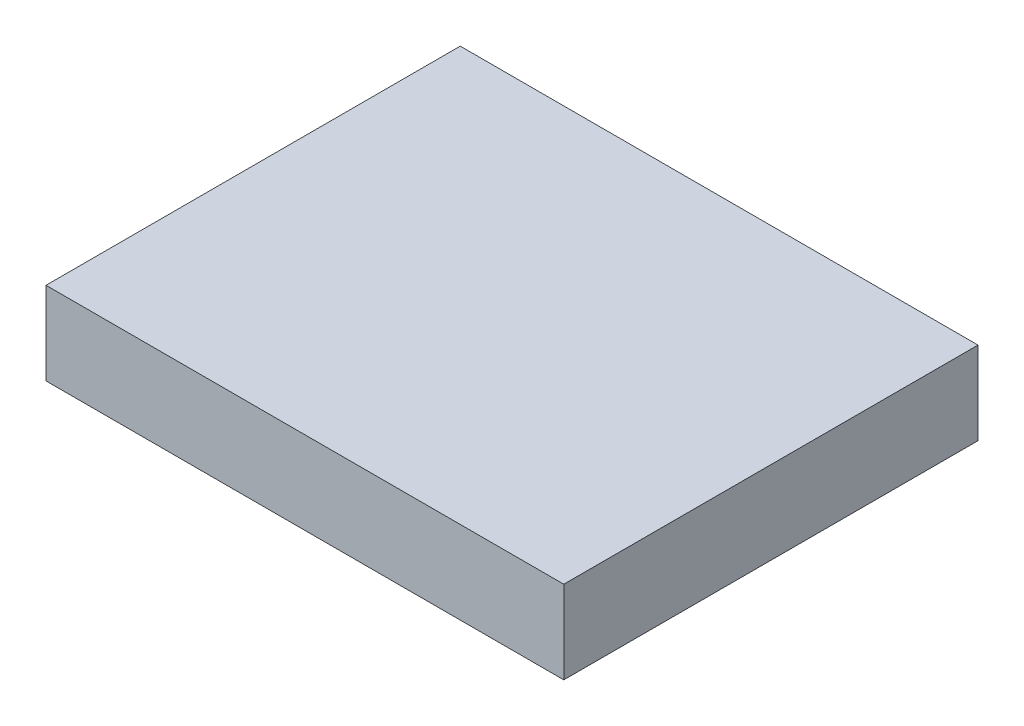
ISO-10303-21;
HEADER;
FILE_DESCRIPTION(('STEP AP214'),'2;1');
FILE_NAME('part.step','',(''),(''),'','','');
FILE_SCHEMA(('AUTOMOTIVE_DESIGN { 1 0 10303 214 1 1 1 1 }'));
ENDSEC;
DATA;
#1=APPLICATION_CONTEXT('core data for automotive mechanical design processes');
#2=APPLICATION_PROTOCOL_DEFINITION('international standard','automotive_design',2000,#1);
#3=PRODUCT_CONTEXT('',#1,'mechanical');
#4=PRODUCT('Part','Part','',(#3));
#5=PRODUCT_RELATED_PRODUCT_CATEGORY('part','',(#4));
#6=PRODUCT_DEFINITION_FORMATION('','',#4);
#7=PRODUCT_DEFINITION_CONTEXT('part definition',#1,'design');
#8=PRODUCT_DEFINITION('design','',#6,#7);
#9=PRODUCT_DEFINITION_SHAPE('','',#8);
#10=(LENGTH_UNIT() NAMED_UNIT(*) SI_UNIT(.MILLI.,.METRE.));
#11=(NAMED_UNIT(*) PLANE_ANGLE_UNIT() SI_UNIT($,.RADIAN.));
#12=(NAMED_UNIT(*) SI_UNIT($,.STERADIAN.) SOLID_ANGLE_UNIT());
#13=UNCERTAINTY_MEASURE_WITH_UNIT(LENGTH_MEASURE(1.E-05),#10,'distance_accuracy_value','');
#14=(GEOMETRIC_REPRESENTATION_CONTEXT(3) GLOBAL_UNCERTAINTY_ASSIGNED_CONTEXT((#13)) GLOBAL_UNIT_ASSIGNED_CONTEXT((#10,
#11,#12)) REPRESENTATION_CONTEXT('',''));
#15=CARTESIAN_POINT('',(0.,0.,0.));
#16=DIRECTION('',(0.,0.,1.));
#17=DIRECTION('',(1.,0.,0.));
#18=AXIS2_PLACEMENT_3D('',#15,#16,#17);
#19=CARTESIAN_POINT('',(0.,8.,0.));
#20=DIRECTION('',(1.,0.,0.));
#21=DIRECTION('',(0.,0.,-1.));
#22=AXIS2_PLACEMENT_3D('',#19,#20,#21);
#23=PLANE('',#22);
#24=DIRECTION('',(0.,0.,1.));
#25=VECTOR('',#24,1.);
#26=CARTESIAN_POINT('',(0.,0.,0.));
#27=LINE('',#26,#25);
#28=CARTESIAN_POINT('',(0.,0.,-40.));
#29=VERTEX_POINT('',#28);
#30=CARTESIAN_POINT('',(0.,0.,0.));
#31=VERTEX_POINT('',#30);
#32=EDGE_CURVE('E74',#29,#31,#27,.T.);
#33=ORIENTED_EDGE('',*,*,#32,.T.);
#34=DIRECTION('',(0.,-1.,0.));
#35=VECTOR('',#34,1.);
#36=CARTESIAN_POINT('',(0.,8.,0.));
#37=LINE('',#36,#35);
#38=CARTESIAN_POINT('',(0.,8.,0.));
#39=VERTEX_POINT('',#38);
#40=EDGE_CURVE('E11',#39,#31,#37,.T.);
#41=ORIENTED_EDGE('',*,*,#40,.F.);
#42=DIRECTION('',(0.,0.,1.));
#43=VECTOR('',#42,1.);
#44=CARTESIAN_POINT('',(0.,8.,0.));
#45=LINE('',#44,#43);
#46=CARTESIAN_POINT('',(0.,8.,-40.));
#47=VERTEX_POINT('',#46);
#48=EDGE_CURVE('E92',#47,#39,#45,.T.);
#49=ORIENTED_EDGE('',*,*,#48,.F.);
#50=DIRECTION('',(0.,-1.,0.));
#51=VECTOR('',#50,1.);
#52=CARTESIAN_POINT('',(0.,8.,-40.));
#53=LINE('',#52,#51);
#54=EDGE_CURVE('E86',#47,#29,#53,.T.);
#55=ORIENTED_EDGE('',*,*,#54,.T.);
#56=EDGE_LOOP('',(#33,#41,#49,#55));
#57=FACE_BOUND('',#56,.T.);
#58=ADVANCED_FACE('F30',(#57),#23,.F.);
#59=CARTESIAN_POINT('',(0.,8.,0.));
#60=DIRECTION('',(0.,0.,-1.));
#61=DIRECTION('',(-1.,0.,0.));
#62=AXIS2_PLACEMENT_3D('',#59,#60,#61);
#63=PLANE('',#62);
#64=DIRECTION('',(1.,0.,0.));
#65=VECTOR('',#64,1.);
#66=CARTESIAN_POINT('',(0.,0.,0.));
#67=LINE('',#66,#65);
#68=CARTESIAN_POINT('',(50.,0.,0.));
#69=VERTEX_POINT('',#68);
#70=EDGE_CURVE('E70',#31,#69,#67,.T.);
#71=ORIENTED_EDGE('',*,*,#70,.T.);
#72=DIRECTION('',(0.,-1.,0.));
#73=VECTOR('',#72,1.);
#74=CARTESIAN_POINT('',(50.,8.,0.));
#75=LINE('',#74,#73);
#76=CARTESIAN_POINT('',(50.,8.,0.));
#77=VERTEX_POINT('',#76);
#78=EDGE_CURVE('E37',#77,#69,#75,.T.);
#79=ORIENTED_EDGE('',*,*,#78,.F.);
#80=DIRECTION('',(1.,0.,0.));
#81=VECTOR('',#80,1.);
#82=CARTESIAN_POINT('',(0.,8.,0.));
#83=LINE('',#82,#81);
#84=EDGE_CURVE('E82',#39,#77,#83,.T.);
#85=ORIENTED_EDGE('',*,*,#84,.F.);
#86=ORIENTED_EDGE('',*,*,#40,.T.);
#87=EDGE_LOOP('',(#71,#79,#85,#86));
#88=FACE_BOUND('',#87,.T.);
#89=ADVANCED_FACE('F81',(#88),#63,.F.);
#90=CARTESIAN_POINT('',(50.,8.,0.));
#91=DIRECTION('',(-1.,0.,0.));
#92=DIRECTION('',(0.,0.,1.));
#93=AXIS2_PLACEMENT_3D('',#90,#91,#92);
#94=PLANE('',#93);
#95=DIRECTION('',(0.,0.,-1.));
#96=VECTOR('',#95,1.);
#97=CARTESIAN_POINT('',(50.,0.,0.));
#98=LINE('',#97,#96);
#99=CARTESIAN_POINT('',(50.,0.,-40.));
#100=VERTEX_POINT('',#99);
#101=EDGE_CURVE('E75',#69,#100,#98,.T.);
#102=ORIENTED_EDGE('',*,*,#101,.T.);
#103=DIRECTION('',(0.,-1.,0.));
#104=VECTOR('',#103,1.);
#105=CARTESIAN_POINT('',(50.,8.,-40.));
#106=LINE('',#105,#104);
#107=CARTESIAN_POINT('',(50.,8.,-40.));
#108=VERTEX_POINT('',#107);
#109=EDGE_CURVE('E98',#108,#100,#106,.T.);
#110=ORIENTED_EDGE('',*,*,#109,.F.);
#111=DIRECTION('',(0.,0.,-1.));
#112=VECTOR('',#111,1.);
#113=CARTESIAN_POINT('',(50.,8.,0.));
#114=LINE('',#113,#112);
#115=EDGE_CURVE('E49',#77,#108,#114,.T.);
#116=ORIENTED_EDGE('',*,*,#115,.F.);
#117=ORIENTED_EDGE('',*,*,#78,.T.);
#118=EDGE_LOOP('',(#102,#110,#116,#117));
#119=FACE_BOUND('',#118,.T.);
#120=ADVANCED_FACE('F101',(#119),#94,.F.);
#121=CARTESIAN_POINT('',(0.,8.,-40.));
#122=DIRECTION('',(0.,0.,1.));
#123=DIRECTION('',(1.,0.,0.));
#124=AXIS2_PLACEMENT_3D('',#121,#122,#123);
#125=PLANE('',#124);
#126=DIRECTION('',(-1.,0.,0.));
#127=VECTOR('',#126,1.);
#128=CARTESIAN_POINT('',(0.,0.,-40.));
#129=LINE('',#128,#127);
#130=EDGE_CURVE('E90',#100,#29,#129,.T.);
#131=ORIENTED_EDGE('',*,*,#130,.T.);
#132=ORIENTED_EDGE('',*,*,#54,.F.);
#133=DIRECTION('',(-1.,0.,0.));
#134=VECTOR('',#133,1.);
#135=CARTESIAN_POINT('',(0.,8.,-40.));
#136=LINE('',#135,#134);
#137=EDGE_CURVE('E44',#108,#47,#136,.T.);
#138=ORIENTED_EDGE('',*,*,#137,.F.);
#139=ORIENTED_EDGE('',*,*,#109,.T.);
#140=EDGE_LOOP('',(#131,#132,#138,#139));
#141=FACE_BOUND('',#140,.T.);
#142=ADVANCED_FACE('F103',(#141),#125,.F.);
#143=CARTESIAN_POINT('',(0.,8.,-40.));
#144=DIRECTION('',(0.,-1.,0.));
#145=DIRECTION('',(0.,0.,-1.));
#146=AXIS2_PLACEMENT_3D('',#143,#144,#145);
#147=PLANE('',#146);
#148=ORIENTED_EDGE('',*,*,#48,.T.);
#149=ORIENTED_EDGE('',*,*,#84,.T.);
#150=ORIENTED_EDGE('',*,*,#115,.T.);
#151=ORIENTED_EDGE('',*,*,#137,.T.);
#152=EDGE_LOOP('',(#148,#149,#150,#151));
#153=FACE_BOUND('',#152,.T.);
#154=ADVANCED_FACE('F104',(#153),#147,.F.);
#155=CARTESIAN_POINT('',(0.,0.,-40.));
#156=DIRECTION('',(0.,-1.,0.));
#157=DIRECTION('',(0.,0.,-1.));
#158=AXIS2_PLACEMENT_3D('',#155,#156,#157);
#159=PLANE('',#158);
#160=ORIENTED_EDGE('',*,*,#32,.F.);
#161=ORIENTED_EDGE('',*,*,#130,.F.);
#162=ORIENTED_EDGE('',*,*,#101,.F.);
#163=ORIENTED_EDGE('',*,*,#70,.F.);
#164=EDGE_LOOP('',(#160,#161,#162,#163));
#165=FACE_BOUND('',#164,.T.);
#166=ADVANCED_FACE('F71',(#165),#159,.T.);
#167=CLOSED_SHELL('',(#58,#89,#120,#142,#154,#166));
#168=MANIFOLD_SOLID_BREP('B2',#167);
#169=ADVANCED_BREP_SHAPE_REPRESENTATION('',(#18,#168),#14);
#170=SHAPE_DEFINITION_REPRESENTATION(#9,#169);
ENDSEC;
END-ISO-10303-21;
